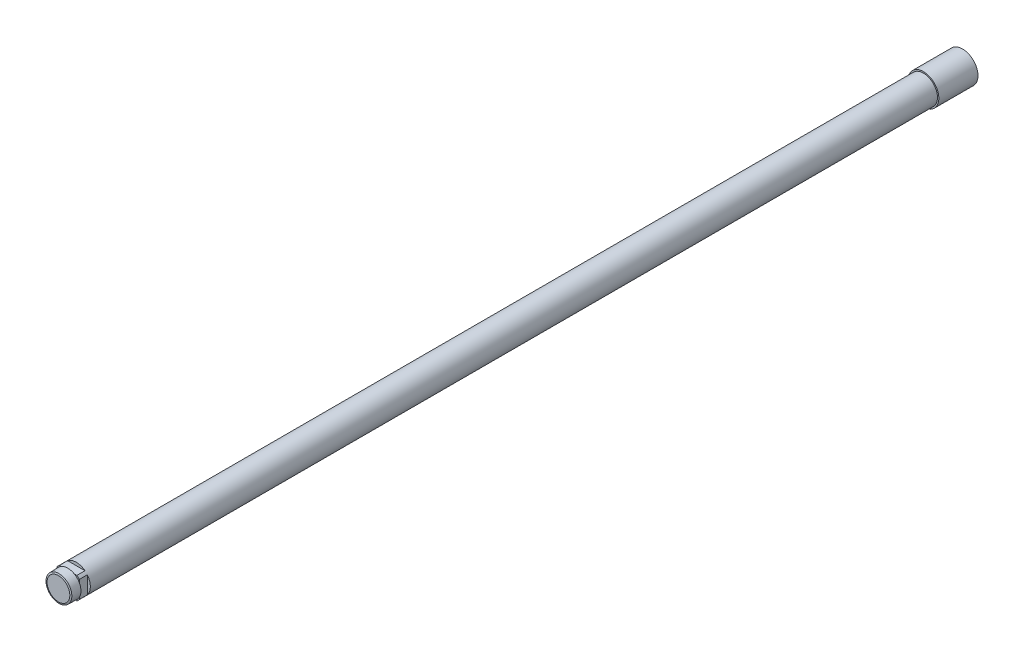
ISO-10303-21;
HEADER;
FILE_DESCRIPTION(('STEP AP214'),'2;1');
FILE_NAME('part.step','',(''),(''),'','','');
FILE_SCHEMA(('AUTOMOTIVE_DESIGN { 1 0 10303 214 1 1 1 1 }'));
ENDSEC;
DATA;
#1=APPLICATION_CONTEXT('core data for automotive mechanical design processes');
#2=APPLICATION_PROTOCOL_DEFINITION('international standard','automotive_design',2000,#1);
#3=PRODUCT_CONTEXT('',#1,'mechanical');
#4=PRODUCT('Part','Part','',(#3));
#5=PRODUCT_RELATED_PRODUCT_CATEGORY('part','',(#4));
#6=PRODUCT_DEFINITION_FORMATION('','',#4);
#7=PRODUCT_DEFINITION_CONTEXT('part definition',#1,'design');
#8=PRODUCT_DEFINITION('design','',#6,#7);
#9=PRODUCT_DEFINITION_SHAPE('','',#8);
#10=(LENGTH_UNIT() NAMED_UNIT(*) SI_UNIT(.MILLI.,.METRE.));
#11=(NAMED_UNIT(*) PLANE_ANGLE_UNIT() SI_UNIT($,.RADIAN.));
#12=(NAMED_UNIT(*) SI_UNIT($,.STERADIAN.) SOLID_ANGLE_UNIT());
#13=UNCERTAINTY_MEASURE_WITH_UNIT(LENGTH_MEASURE(1.E-05),#10,'distance_accuracy_value','');
#14=(GEOMETRIC_REPRESENTATION_CONTEXT(3) GLOBAL_UNCERTAINTY_ASSIGNED_CONTEXT((#13)) GLOBAL_UNIT_ASSIGNED_CONTEXT((#10,
#11,#12)) REPRESENTATION_CONTEXT('',''));
#15=CARTESIAN_POINT('',(0.,0.,0.));
#16=DIRECTION('',(0.,0.,1.));
#17=DIRECTION('',(1.,0.,0.));
#18=AXIS2_PLACEMENT_3D('',#15,#16,#17);
#19=CARTESIAN_POINT('',(0.,0.,554.3042));
#20=DIRECTION('',(0.,0.,1.));
#21=DIRECTION('',(1.,0.,0.));
#22=AXIS2_PLACEMENT_3D('',#19,#20,#21);
#23=PLANE('',#22);
#24=CARTESIAN_POINT('',(0.,0.,554.3042));
#25=DIRECTION('',(0.,0.,-1.));
#26=DIRECTION('',(-1.,0.,0.));
#27=AXIS2_PLACEMENT_3D('',#24,#25,#26);
#28=CIRCLE('',#27,17.9959);
#29=CARTESIAN_POINT('',(-17.9959,0.,554.3042));
#30=VERTEX_POINT('',#29);
#31=EDGE_CURVE('E132',#30,#30,#28,.T.);
#32=ORIENTED_EDGE('',*,*,#31,.F.);
#33=EDGE_LOOP('',(#32));
#34=FACE_BOUND('',#33,.T.);
#35=ADVANCED_FACE('F35',(#34),#23,.T.);
#36=CARTESIAN_POINT('',(0.,0.,553.5583925));
#37=DIRECTION('',(0.,0.,-1.));
#38=DIRECTION('',(-1.,0.,0.));
#39=AXIS2_PLACEMENT_3D('',#36,#37,#38);
#40=CONICAL_SURFACE('',#39,20.4193773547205,1.27225134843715);
#41=CARTESIAN_POINT('',(0.,0.,553.5583925));
#42=DIRECTION('',(0.,0.,-1.));
#43=DIRECTION('',(-1.,0.,0.));
#44=AXIS2_PLACEMENT_3D('',#41,#42,#43);
#45=CIRCLE('',#44,20.4193773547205);
#46=CARTESIAN_POINT('',(-20.4193773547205,0.,553.5583925));
#47=VERTEX_POINT('',#46);
#48=EDGE_CURVE('E128',#47,#47,#45,.T.);
#49=ORIENTED_EDGE('',*,*,#48,.F.);
#50=EDGE_LOOP('',(#49));
#51=FACE_BOUND('',#50,.T.);
#52=ORIENTED_EDGE('',*,*,#31,.T.);
#53=EDGE_LOOP('',(#52));
#54=FACE_BOUND('',#53,.T.);
#55=ADVANCED_FACE('F367',(#51,#54),#40,.T.);
#56=CARTESIAN_POINT('',(0.,0.,538.8356));
#57=DIRECTION('',(0.,0.,1.));
#58=DIRECTION('',(1.,0.,0.));
#59=AXIS2_PLACEMENT_3D('',#56,#57,#58);
#60=PLANE('',#59);
#61=DIRECTION('',(1.,0.,0.));
#62=VECTOR('',#61,1.);
#63=CARTESIAN_POINT('',(-17.4625,-17.4625,538.8356));
#64=LINE('',#63,#62);
#65=CARTESIAN_POINT('',(6.03708657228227,-17.4625,538.8356));
#66=VERTEX_POINT('',#65);
#67=CARTESIAN_POINT('',(-6.03708657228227,-17.4625,538.8356));
#68=VERTEX_POINT('',#67);
#69=EDGE_CURVE('E138',#66,#68,#64,.F.);
#70=ORIENTED_EDGE('',*,*,#69,.F.);
#71=CARTESIAN_POINT('',(0.,0.,538.8356));
#72=DIRECTION('',(0.,0.,1.));
#73=DIRECTION('',(1.,0.,0.));
#74=AXIS2_PLACEMENT_3D('',#71,#72,#73);
#75=CIRCLE('',#74,18.4766155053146);
#76=EDGE_CURVE('E247',#68,#66,#75,.T.);
#77=ORIENTED_EDGE('',*,*,#76,.F.);
#78=EDGE_LOOP('',(#70,#77));
#79=FACE_BOUND('',#78,.T.);
#80=ADVANCED_FACE('F249',(#79),#60,.F.);
#81=CARTESIAN_POINT('',(0.,0.,539.5814075));
#82=DIRECTION('',(0.,0.,-1.));
#83=DIRECTION('',(-1.,0.,0.));
#84=AXIS2_PLACEMENT_3D('',#81,#82,#83);
#85=CONICAL_SURFACE('',#84,20.8537381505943,0.0310668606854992);
#86=CARTESIAN_POINT('',(0.,0.,539.5814075));
#87=DIRECTION('',(0.,0.,1.));
#88=DIRECTION('',(1.,0.,0.));
#89=AXIS2_PLACEMENT_3D('',#86,#87,#88);
#90=CIRCLE('',#89,20.8537381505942);
#91=CARTESIAN_POINT('',(20.8537381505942,0.,539.5814075));
#92=VERTEX_POINT('',#91);
#93=EDGE_CURVE('E133',#92,#92,#90,.F.);
#94=ORIENTED_EDGE('',*,*,#93,.F.);
#95=EDGE_LOOP('',(#94));
#96=FACE_BOUND('',#95,.T.);
#97=ORIENTED_EDGE('',*,*,#48,.T.);
#98=EDGE_LOOP('',(#97));
#99=FACE_BOUND('',#98,.T.);
#100=ADVANCED_FACE('F361',(#96,#99),#85,.T.);
#101=CARTESIAN_POINT('',(0.,0.,526.1356));
#102=DIRECTION('',(0.,0.,1.));
#103=DIRECTION('',(1.,0.,0.));
#104=AXIS2_PLACEMENT_3D('',#101,#102,#103);
#105=PLANE('',#104);
#106=CARTESIAN_POINT('',(0.,0.,526.1356));
#107=DIRECTION('',(0.,0.,-1.));
#108=DIRECTION('',(-1.,0.,0.));
#109=AXIS2_PLACEMENT_3D('',#106,#107,#108);
#110=CIRCLE('',#109,22.225);
#111=CARTESIAN_POINT('',(13.748153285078,-17.4625,526.1356));
#112=VERTEX_POINT('',#111);
#113=CARTESIAN_POINT('',(-13.748153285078,-17.4625,526.1356));
#114=VERTEX_POINT('',#113);
#115=EDGE_CURVE('E145',#112,#114,#110,.T.);
#116=ORIENTED_EDGE('',*,*,#115,.F.);
#117=DIRECTION('',(1.,0.,0.));
#118=VECTOR('',#117,1.);
#119=CARTESIAN_POINT('',(-17.4625,-17.4625,526.1356));
#120=LINE('',#119,#118);
#121=EDGE_CURVE('E131',#114,#112,#120,.T.);
#122=ORIENTED_EDGE('',*,*,#121,.F.);
#123=EDGE_LOOP('',(#116,#122));
#124=FACE_BOUND('',#123,.T.);
#125=ADVANCED_FACE('F271',(#124),#105,.T.);
#126=CARTESIAN_POINT('',(-17.4625,-17.4625,526.1356));
#127=DIRECTION('',(0.,-1.,0.));
#128=DIRECTION('',(0.,0.,-1.));
#129=AXIS2_PLACEMENT_3D('',#126,#127,#128);
#130=PLANE('',#129);
#131=DIRECTION('',(1.,0.,0.));
#132=VECTOR('',#131,1.);
#133=CARTESIAN_POINT('',(0.,-17.4625,538.8356));
#134=LINE('',#133,#132);
#135=CARTESIAN_POINT('',(-13.748153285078,-17.4625,538.8356));
#136=VERTEX_POINT('',#135);
#137=EDGE_CURVE('E141',#136,#68,#134,.T.);
#138=ORIENTED_EDGE('',*,*,#137,.F.);
#139=DIRECTION('',(0.,0.,-1.));
#140=VECTOR('',#139,1.);
#141=CARTESIAN_POINT('',(-13.748153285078,-17.4625,554.3042));
#142=LINE('',#141,#140);
#143=EDGE_CURVE('E149',#114,#136,#142,.F.);
#144=ORIENTED_EDGE('',*,*,#143,.F.);
#145=ORIENTED_EDGE('',*,*,#121,.T.);
#146=DIRECTION('',(0.,0.,-1.));
#147=VECTOR('',#146,1.);
#148=CARTESIAN_POINT('',(13.748153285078,-17.4625,554.3042));
#149=LINE('',#148,#147);
#150=CARTESIAN_POINT('',(13.748153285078,-17.4625,538.8356));
#151=VERTEX_POINT('',#150);
#152=EDGE_CURVE('E142',#151,#112,#149,.T.);
#153=ORIENTED_EDGE('',*,*,#152,.F.);
#154=DIRECTION('',(1.,0.,0.));
#155=VECTOR('',#154,1.);
#156=CARTESIAN_POINT('',(0.,-17.4625,538.8356));
#157=LINE('',#156,#155);
#158=EDGE_CURVE('E172',#66,#151,#157,.T.);
#159=ORIENTED_EDGE('',*,*,#158,.F.);
#160=ORIENTED_EDGE('',*,*,#69,.T.);
#161=EDGE_LOOP('',(#138,#144,#145,#153,#159,#160));
#162=FACE_BOUND('',#161,.T.);
#163=ADVANCED_FACE('F260',(#162),#130,.T.);
#164=CARTESIAN_POINT('',(0.,22.225,538.8356));
#165=DIRECTION('',(0.,0.,1.));
#166=DIRECTION('',(1.,0.,0.));
#167=AXIS2_PLACEMENT_3D('',#164,#165,#166);
#168=PLANE('',#167);
#169=DIRECTION('',(0.,1.,0.));
#170=VECTOR('',#169,1.);
#171=CARTESIAN_POINT('',(-17.4625,-17.4625,538.8356));
#172=LINE('',#171,#170);
#173=CARTESIAN_POINT('',(-17.4625,-13.748153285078,538.8356));
#174=VERTEX_POINT('',#173);
#175=CARTESIAN_POINT('',(-17.4625,-6.03708657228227,538.8356));
#176=VERTEX_POINT('',#175);
#177=EDGE_CURVE('E154',#174,#176,#172,.T.);
#178=ORIENTED_EDGE('',*,*,#177,.F.);
#179=CARTESIAN_POINT('',(0.,0.,538.8356));
#180=DIRECTION('',(0.,0.,-1.));
#181=DIRECTION('',(-1.,0.,0.));
#182=AXIS2_PLACEMENT_3D('',#179,#180,#181);
#183=CIRCLE('',#182,22.225);
#184=EDGE_CURVE('E54',#136,#174,#183,.T.);
#185=ORIENTED_EDGE('',*,*,#184,.F.);
#186=ORIENTED_EDGE('',*,*,#137,.T.);
#187=CARTESIAN_POINT('',(0.,0.,538.8356));
#188=DIRECTION('',(0.,0.,1.));
#189=DIRECTION('',(1.,0.,0.));
#190=AXIS2_PLACEMENT_3D('',#187,#188,#189);
#191=CIRCLE('',#190,18.4766155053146);
#192=EDGE_CURVE('E137',#68,#176,#191,.F.);
#193=ORIENTED_EDGE('',*,*,#192,.T.);
#194=EDGE_LOOP('',(#178,#185,#186,#193));
#195=FACE_BOUND('',#194,.T.);
#196=ADVANCED_FACE('F280',(#195),#168,.T.);
#197=CARTESIAN_POINT('',(0.,0.,538.8356));
#198=DIRECTION('',(0.,0.,1.));
#199=DIRECTION('',(1.,0.,0.));
#200=AXIS2_PLACEMENT_3D('',#197,#198,#199);
#201=PLANE('',#200);
#202=DIRECTION('',(0.,1.,0.));
#203=VECTOR('',#202,1.);
#204=CARTESIAN_POINT('',(-17.4625,-17.4625,538.8356));
#205=LINE('',#204,#203);
#206=CARTESIAN_POINT('',(-17.4625,6.03708657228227,538.8356));
#207=VERTEX_POINT('',#206);
#208=EDGE_CURVE('E160',#176,#207,#205,.T.);
#209=ORIENTED_EDGE('',*,*,#208,.F.);
#210=CARTESIAN_POINT('',(0.,0.,538.8356));
#211=DIRECTION('',(0.,0.,1.));
#212=DIRECTION('',(1.,0.,0.));
#213=AXIS2_PLACEMENT_3D('',#210,#211,#212);
#214=CIRCLE('',#213,18.4766155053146);
#215=EDGE_CURVE('E257',#207,#176,#214,.T.);
#216=ORIENTED_EDGE('',*,*,#215,.F.);
#217=EDGE_LOOP('',(#209,#216));
#218=FACE_BOUND('',#217,.T.);
#219=ADVANCED_FACE('F275',(#218),#201,.F.);
#220=CARTESIAN_POINT('',(0.,0.,538.8356));
#221=DIRECTION('',(0.,0.,1.));
#222=DIRECTION('',(1.,0.,0.));
#223=AXIS2_PLACEMENT_3D('',#220,#221,#222);
#224=PLANE('',#223);
#225=DIRECTION('',(1.,0.,0.));
#226=VECTOR('',#225,1.);
#227=CARTESIAN_POINT('',(-17.4625,17.4625,538.8356));
#228=LINE('',#227,#226);
#229=CARTESIAN_POINT('',(-6.03708657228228,17.4625,538.8356));
#230=VERTEX_POINT('',#229);
#231=CARTESIAN_POINT('',(6.03708657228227,17.4625,538.8356));
#232=VERTEX_POINT('',#231);
#233=EDGE_CURVE('E164',#230,#232,#228,.T.);
#234=ORIENTED_EDGE('',*,*,#233,.F.);
#235=CARTESIAN_POINT('',(0.,0.,538.8356));
#236=DIRECTION('',(0.,0.,1.));
#237=DIRECTION('',(1.,0.,0.));
#238=AXIS2_PLACEMENT_3D('',#235,#236,#237);
#239=CIRCLE('',#238,18.4766155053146);
#240=EDGE_CURVE('E136',#232,#230,#239,.T.);
#241=ORIENTED_EDGE('',*,*,#240,.F.);
#242=EDGE_LOOP('',(#234,#241));
#243=FACE_BOUND('',#242,.T.);
#244=ADVANCED_FACE('F348',(#243),#224,.F.);
#245=CARTESIAN_POINT('',(0.,0.,539.5814075));
#246=DIRECTION('',(0.,0.,1.));
#247=DIRECTION('',(1.,0.,0.));
#248=AXIS2_PLACEMENT_3D('',#245,#246,#247);
#249=CONICAL_SURFACE('',#248,20.8537381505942,1.26677871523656);
#250=ORIENTED_EDGE('',*,*,#93,.T.);
#251=EDGE_LOOP('',(#250));
#252=FACE_BOUND('',#251,.T.);
#253=ORIENTED_EDGE('',*,*,#240,.T.);
#254=CARTESIAN_POINT('',(0.,0.,538.8356));
#255=DIRECTION('',(0.,0.,1.));
#256=DIRECTION('',(1.,0.,0.));
#257=AXIS2_PLACEMENT_3D('',#254,#255,#256);
#258=CIRCLE('',#257,18.4766155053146);
#259=EDGE_CURVE('E187',#207,#230,#258,.F.);
#260=ORIENTED_EDGE('',*,*,#259,.F.);
#261=ORIENTED_EDGE('',*,*,#215,.T.);
#262=ORIENTED_EDGE('',*,*,#192,.F.);
#263=ORIENTED_EDGE('',*,*,#76,.T.);
#264=CARTESIAN_POINT('',(0.,0.,538.8356));
#265=DIRECTION('',(0.,0.,1.));
#266=DIRECTION('',(1.,0.,0.));
#267=AXIS2_PLACEMENT_3D('',#264,#265,#266);
#268=CIRCLE('',#267,18.4766155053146);
#269=CARTESIAN_POINT('',(17.4625,-6.03708657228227,538.8356));
#270=VERTEX_POINT('',#269);
#271=EDGE_CURVE('E175',#270,#66,#268,.F.);
#272=ORIENTED_EDGE('',*,*,#271,.F.);
#273=CARTESIAN_POINT('',(0.,0.,538.8356));
#274=DIRECTION('',(0.,0.,1.));
#275=DIRECTION('',(1.,0.,0.));
#276=AXIS2_PLACEMENT_3D('',#273,#274,#275);
#277=CIRCLE('',#276,18.4766155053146);
#278=CARTESIAN_POINT('',(17.4625,6.03708657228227,538.8356));
#279=VERTEX_POINT('',#278);
#280=EDGE_CURVE('E176',#270,#279,#277,.T.);
#281=ORIENTED_EDGE('',*,*,#280,.T.);
#282=CARTESIAN_POINT('',(0.,0.,538.8356));
#283=DIRECTION('',(0.,0.,1.));
#284=DIRECTION('',(1.,0.,0.));
#285=AXIS2_PLACEMENT_3D('',#282,#283,#284);
#286=CIRCLE('',#285,18.4766155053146);
#287=EDGE_CURVE('E102',#232,#279,#286,.F.);
#288=ORIENTED_EDGE('',*,*,#287,.F.);
#289=EDGE_LOOP('',(#253,#260,#261,#262,#263,#272,#281,#288));
#290=FACE_BOUND('',#289,.T.);
#291=ADVANCED_FACE('F253',(#252,#290),#249,.T.);
#292=CARTESIAN_POINT('',(0.,0.,538.8356));
#293=DIRECTION('',(0.,0.,1.));
#294=DIRECTION('',(1.,0.,0.));
#295=AXIS2_PLACEMENT_3D('',#292,#293,#294);
#296=PLANE('',#295);
#297=DIRECTION('',(0.,1.,0.));
#298=VECTOR('',#297,1.);
#299=CARTESIAN_POINT('',(17.4625,-17.4625,538.8356));
#300=LINE('',#299,#298);
#301=EDGE_CURVE('E106',#279,#270,#300,.F.);
#302=ORIENTED_EDGE('',*,*,#301,.F.);
#303=ORIENTED_EDGE('',*,*,#280,.F.);
#304=EDGE_LOOP('',(#302,#303));
#305=FACE_BOUND('',#304,.T.);
#306=ADVANCED_FACE('F342',(#305),#296,.F.);
#307=CARTESIAN_POINT('',(0.,22.225,538.8356));
#308=DIRECTION('',(0.,0.,1.));
#309=DIRECTION('',(1.,0.,0.));
#310=AXIS2_PLACEMENT_3D('',#307,#308,#309);
#311=PLANE('',#310);
#312=ORIENTED_EDGE('',*,*,#158,.T.);
#313=CARTESIAN_POINT('',(0.,0.,538.8356));
#314=DIRECTION('',(0.,0.,-1.));
#315=DIRECTION('',(-1.,0.,0.));
#316=AXIS2_PLACEMENT_3D('',#313,#314,#315);
#317=CIRCLE('',#316,22.225);
#318=CARTESIAN_POINT('',(17.4625,-13.748153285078,538.8356));
#319=VERTEX_POINT('',#318);
#320=EDGE_CURVE('E146',#319,#151,#317,.T.);
#321=ORIENTED_EDGE('',*,*,#320,.F.);
#322=DIRECTION('',(0.,1.,0.));
#323=VECTOR('',#322,1.);
#324=CARTESIAN_POINT('',(17.4625,-17.4625,538.8356));
#325=LINE('',#324,#323);
#326=EDGE_CURVE('E170',#270,#319,#325,.F.);
#327=ORIENTED_EDGE('',*,*,#326,.F.);
#328=ORIENTED_EDGE('',*,*,#271,.T.);
#329=EDGE_LOOP('',(#312,#321,#327,#328));
#330=FACE_BOUND('',#329,.T.);
#331=ADVANCED_FACE('F264',(#330),#311,.T.);
#332=CARTESIAN_POINT('',(0.,0.,526.1356));
#333=DIRECTION('',(0.,0.,1.));
#334=DIRECTION('',(1.,0.,0.));
#335=AXIS2_PLACEMENT_3D('',#332,#333,#334);
#336=PLANE('',#335);
#337=CARTESIAN_POINT('',(0.,0.,526.1356));
#338=DIRECTION('',(0.,0.,-1.));
#339=DIRECTION('',(-1.,0.,0.));
#340=AXIS2_PLACEMENT_3D('',#337,#338,#339);
#341=CIRCLE('',#340,22.225);
#342=CARTESIAN_POINT('',(17.4625,13.748153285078,526.1356));
#343=VERTEX_POINT('',#342);
#344=CARTESIAN_POINT('',(17.4625,-13.748153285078,526.1356));
#345=VERTEX_POINT('',#344);
#346=EDGE_CURVE('E116',#343,#345,#341,.T.);
#347=ORIENTED_EDGE('',*,*,#346,.F.);
#348=DIRECTION('',(0.,1.,0.));
#349=VECTOR('',#348,1.);
#350=CARTESIAN_POINT('',(17.4625,-17.4625,526.1356));
#351=LINE('',#350,#349);
#352=EDGE_CURVE('E107',#345,#343,#351,.T.);
#353=ORIENTED_EDGE('',*,*,#352,.F.);
#354=EDGE_LOOP('',(#347,#353));
#355=FACE_BOUND('',#354,.T.);
#356=ADVANCED_FACE('F335',(#355),#336,.T.);
#357=CARTESIAN_POINT('',(0.,0.,526.1356));
#358=DIRECTION('',(0.,0.,1.));
#359=DIRECTION('',(1.,0.,0.));
#360=AXIS2_PLACEMENT_3D('',#357,#358,#359);
#361=PLANE('',#360);
#362=CARTESIAN_POINT('',(0.,0.,526.1356));
#363=DIRECTION('',(0.,0.,-1.));
#364=DIRECTION('',(-1.,0.,0.));
#365=AXIS2_PLACEMENT_3D('',#362,#363,#364);
#366=CIRCLE('',#365,22.225);
#367=CARTESIAN_POINT('',(-17.4625,-13.748153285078,526.1356));
#368=VERTEX_POINT('',#367);
#369=CARTESIAN_POINT('',(-17.4625,13.748153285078,526.1356));
#370=VERTEX_POINT('',#369);
#371=EDGE_CURVE('E184',#368,#370,#366,.T.);
#372=ORIENTED_EDGE('',*,*,#371,.F.);
#373=DIRECTION('',(0.,1.,0.));
#374=VECTOR('',#373,1.);
#375=CARTESIAN_POINT('',(-17.4625,-17.4625,526.1356));
#376=LINE('',#375,#374);
#377=EDGE_CURVE('E155',#370,#368,#376,.F.);
#378=ORIENTED_EDGE('',*,*,#377,.F.);
#379=EDGE_LOOP('',(#372,#378));
#380=FACE_BOUND('',#379,.T.);
#381=ADVANCED_FACE('F332',(#380),#361,.T.);
#382=CARTESIAN_POINT('',(-17.4625,-17.4625,526.1356));
#383=DIRECTION('',(-1.,0.,0.));
#384=DIRECTION('',(0.,0.,1.));
#385=AXIS2_PLACEMENT_3D('',#382,#383,#384);
#386=PLANE('',#385);
#387=DIRECTION('',(0.,1.,0.));
#388=VECTOR('',#387,1.);
#389=CARTESIAN_POINT('',(-17.4625,22.225,538.8356));
#390=LINE('',#389,#388);
#391=CARTESIAN_POINT('',(-17.4625,13.748153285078,538.8356));
#392=VERTEX_POINT('',#391);
#393=EDGE_CURVE('E163',#392,#207,#390,.F.);
#394=ORIENTED_EDGE('',*,*,#393,.F.);
#395=DIRECTION('',(0.,0.,-1.));
#396=VECTOR('',#395,1.);
#397=CARTESIAN_POINT('',(-17.4625,13.748153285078,554.3042));
#398=LINE('',#397,#396);
#399=EDGE_CURVE('E180',#370,#392,#398,.F.);
#400=ORIENTED_EDGE('',*,*,#399,.F.);
#401=ORIENTED_EDGE('',*,*,#377,.T.);
#402=DIRECTION('',(0.,0.,1.));
#403=VECTOR('',#402,1.);
#404=CARTESIAN_POINT('',(-17.4625,-13.748153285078,526.1356));
#405=LINE('',#404,#403);
#406=EDGE_CURVE('E151',#368,#174,#405,.T.);
#407=ORIENTED_EDGE('',*,*,#406,.T.);
#408=ORIENTED_EDGE('',*,*,#177,.T.);
#409=ORIENTED_EDGE('',*,*,#208,.T.);
#410=EDGE_LOOP('',(#394,#400,#401,#407,#408,#409));
#411=FACE_BOUND('',#410,.T.);
#412=ADVANCED_FACE('F278',(#411),#386,.T.);
#413=CARTESIAN_POINT('',(0.,22.225,538.8356));
#414=DIRECTION('',(0.,0.,1.));
#415=DIRECTION('',(1.,0.,0.));
#416=AXIS2_PLACEMENT_3D('',#413,#414,#415);
#417=PLANE('',#416);
#418=DIRECTION('',(1.,0.,0.));
#419=VECTOR('',#418,1.);
#420=CARTESIAN_POINT('',(-17.4625,17.4625,538.8356));
#421=LINE('',#420,#419);
#422=CARTESIAN_POINT('',(-13.748153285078,17.4625,538.8356));
#423=VERTEX_POINT('',#422);
#424=EDGE_CURVE('E167',#423,#230,#421,.T.);
#425=ORIENTED_EDGE('',*,*,#424,.F.);
#426=CARTESIAN_POINT('',(0.,0.,538.8356));
#427=DIRECTION('',(0.,0.,-1.));
#428=DIRECTION('',(-1.,0.,0.));
#429=AXIS2_PLACEMENT_3D('',#426,#427,#428);
#430=CIRCLE('',#429,22.225);
#431=EDGE_CURVE('E183',#392,#423,#430,.T.);
#432=ORIENTED_EDGE('',*,*,#431,.F.);
#433=ORIENTED_EDGE('',*,*,#393,.T.);
#434=ORIENTED_EDGE('',*,*,#259,.T.);
#435=EDGE_LOOP('',(#425,#432,#433,#434));
#436=FACE_BOUND('',#435,.T.);
#437=ADVANCED_FACE('F213',(#436),#417,.T.);
#438=CARTESIAN_POINT('',(0.,0.,526.1356));
#439=DIRECTION('',(0.,0.,1.));
#440=DIRECTION('',(1.,0.,0.));
#441=AXIS2_PLACEMENT_3D('',#438,#439,#440);
#442=PLANE('',#441);
#443=CARTESIAN_POINT('',(0.,0.,526.1356));
#444=DIRECTION('',(0.,0.,-1.));
#445=DIRECTION('',(-1.,0.,0.));
#446=AXIS2_PLACEMENT_3D('',#443,#444,#445);
#447=CIRCLE('',#446,22.225);
#448=CARTESIAN_POINT('',(-13.748153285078,17.4625,526.1356));
#449=VERTEX_POINT('',#448);
#450=CARTESIAN_POINT('',(13.748153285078,17.4625,526.1356));
#451=VERTEX_POINT('',#450);
#452=EDGE_CURVE('E126',#449,#451,#447,.T.);
#453=ORIENTED_EDGE('',*,*,#452,.F.);
#454=DIRECTION('',(1.,0.,0.));
#455=VECTOR('',#454,1.);
#456=CARTESIAN_POINT('',(-17.4625,17.4625,526.1356));
#457=LINE('',#456,#455);
#458=EDGE_CURVE('E190',#451,#449,#457,.F.);
#459=ORIENTED_EDGE('',*,*,#458,.F.);
#460=EDGE_LOOP('',(#453,#459));
#461=FACE_BOUND('',#460,.T.);
#462=ADVANCED_FACE('F198',(#461),#442,.T.);
#463=CARTESIAN_POINT('',(-17.4625,17.4625,526.1356));
#464=DIRECTION('',(0.,1.,0.));
#465=DIRECTION('',(0.,0.,1.));
#466=AXIS2_PLACEMENT_3D('',#463,#464,#465);
#467=PLANE('',#466);
#468=DIRECTION('',(1.,0.,0.));
#469=VECTOR('',#468,1.);
#470=CARTESIAN_POINT('',(0.,17.4625,538.8356));
#471=LINE('',#470,#469);
#472=CARTESIAN_POINT('',(13.748153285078,17.4625,538.8356));
#473=VERTEX_POINT('',#472);
#474=EDGE_CURVE('E39',#473,#232,#471,.F.);
#475=ORIENTED_EDGE('',*,*,#474,.F.);
#476=DIRECTION('',(0.,0.,-1.));
#477=VECTOR('',#476,1.);
#478=CARTESIAN_POINT('',(13.748153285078,17.4625,554.3042));
#479=LINE('',#478,#477);
#480=EDGE_CURVE('E45',#451,#473,#479,.F.);
#481=ORIENTED_EDGE('',*,*,#480,.F.);
#482=ORIENTED_EDGE('',*,*,#458,.T.);
#483=DIRECTION('',(0.,0.,-1.));
#484=VECTOR('',#483,1.);
#485=CARTESIAN_POINT('',(-13.748153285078,17.4625,554.3042));
#486=LINE('',#485,#484);
#487=EDGE_CURVE('E191',#423,#449,#486,.T.);
#488=ORIENTED_EDGE('',*,*,#487,.F.);
#489=ORIENTED_EDGE('',*,*,#424,.T.);
#490=ORIENTED_EDGE('',*,*,#233,.T.);
#491=EDGE_LOOP('',(#475,#481,#482,#488,#489,#490));
#492=FACE_BOUND('',#491,.T.);
#493=ADVANCED_FACE('F201',(#492),#467,.T.);
#494=CARTESIAN_POINT('',(0.,22.225,538.8356));
#495=DIRECTION('',(0.,0.,1.));
#496=DIRECTION('',(1.,0.,0.));
#497=AXIS2_PLACEMENT_3D('',#494,#495,#496);
#498=PLANE('',#497);
#499=DIRECTION('',(0.,1.,0.));
#500=VECTOR('',#499,1.);
#501=CARTESIAN_POINT('',(17.4625,-17.4625,538.8356));
#502=LINE('',#501,#500);
#503=CARTESIAN_POINT('',(17.4625,13.748153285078,538.8356));
#504=VERTEX_POINT('',#503);
#505=EDGE_CURVE('E93',#504,#279,#502,.F.);
#506=ORIENTED_EDGE('',*,*,#505,.F.);
#507=CARTESIAN_POINT('',(0.,0.,538.8356));
#508=DIRECTION('',(0.,0.,-1.));
#509=DIRECTION('',(-1.,0.,0.));
#510=AXIS2_PLACEMENT_3D('',#507,#508,#509);
#511=CIRCLE('',#510,22.225);
#512=EDGE_CURVE('E98',#473,#504,#511,.T.);
#513=ORIENTED_EDGE('',*,*,#512,.F.);
#514=ORIENTED_EDGE('',*,*,#474,.T.);
#515=ORIENTED_EDGE('',*,*,#287,.T.);
#516=EDGE_LOOP('',(#506,#513,#514,#515));
#517=FACE_BOUND('',#516,.T.);
#518=ADVANCED_FACE('F95',(#517),#498,.T.);
#519=CARTESIAN_POINT('',(17.4625,-17.4625,526.1356));
#520=DIRECTION('',(1.,0.,0.));
#521=DIRECTION('',(0.,1.,0.));
#522=AXIS2_PLACEMENT_3D('',#519,#520,#521);
#523=PLANE('',#522);
#524=ORIENTED_EDGE('',*,*,#326,.T.);
#525=DIRECTION('',(0.,0.,1.));
#526=VECTOR('',#525,1.);
#527=CARTESIAN_POINT('',(17.4625,-13.748153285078,526.1356));
#528=LINE('',#527,#526);
#529=EDGE_CURVE('E168',#319,#345,#528,.F.);
#530=ORIENTED_EDGE('',*,*,#529,.T.);
#531=ORIENTED_EDGE('',*,*,#352,.T.);
#532=DIRECTION('',(0.,0.,-1.));
#533=VECTOR('',#532,1.);
#534=CARTESIAN_POINT('',(17.4625,13.748153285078,554.3042));
#535=LINE('',#534,#533);
#536=EDGE_CURVE('E111',#504,#343,#535,.T.);
#537=ORIENTED_EDGE('',*,*,#536,.F.);
#538=ORIENTED_EDGE('',*,*,#505,.T.);
#539=ORIENTED_EDGE('',*,*,#301,.T.);
#540=EDGE_LOOP('',(#524,#530,#531,#537,#538,#539));
#541=FACE_BOUND('',#540,.T.);
#542=ADVANCED_FACE('F113',(#541),#523,.T.);
#543=CARTESIAN_POINT('',(0.,0.,554.3042));
#544=DIRECTION('',(0.,0.,-1.));
#545=DIRECTION('',(-1.,0.,0.));
#546=AXIS2_PLACEMENT_3D('',#543,#544,#545);
#547=CYLINDRICAL_SURFACE('',#546,22.225);
#548=ORIENTED_EDGE('',*,*,#512,.T.);
#549=ORIENTED_EDGE('',*,*,#536,.T.);
#550=ORIENTED_EDGE('',*,*,#346,.T.);
#551=ORIENTED_EDGE('',*,*,#529,.F.);
#552=ORIENTED_EDGE('',*,*,#320,.T.);
#553=ORIENTED_EDGE('',*,*,#152,.T.);
#554=ORIENTED_EDGE('',*,*,#115,.T.);
#555=ORIENTED_EDGE('',*,*,#143,.T.);
#556=ORIENTED_EDGE('',*,*,#184,.T.);
#557=ORIENTED_EDGE('',*,*,#406,.F.);
#558=ORIENTED_EDGE('',*,*,#371,.T.);
#559=ORIENTED_EDGE('',*,*,#399,.T.);
#560=ORIENTED_EDGE('',*,*,#431,.T.);
#561=ORIENTED_EDGE('',*,*,#487,.T.);
#562=ORIENTED_EDGE('',*,*,#452,.T.);
#563=ORIENTED_EDGE('',*,*,#480,.T.);
#564=EDGE_LOOP('',(#548,#549,#550,#551,#552,#553,#554,#555,#556,#557,#558,#559,#560,#561,#562,#563));
#565=FACE_BOUND('',#564,.T.);
#566=CARTESIAN_POINT('',(0.,0.,-812.8));
#567=DIRECTION('',(0.,0.,-1.));
#568=DIRECTION('',(-1.,0.,0.));
#569=AXIS2_PLACEMENT_3D('',#566,#567,#568);
#570=CIRCLE('',#569,22.225);
#571=CARTESIAN_POINT('',(-22.225,0.,-812.8));
#572=VERTEX_POINT('',#571);
#573=EDGE_CURVE('E284',#572,#572,#570,.T.);
#574=ORIENTED_EDGE('',*,*,#573,.F.);
#575=EDGE_LOOP('',(#574));
#576=FACE_BOUND('',#575,.T.);
#577=ADVANCED_FACE('F118',(#565,#576),#547,.T.);
#578=CARTESIAN_POINT('',(0.,0.,-874.6998));
#579=DIRECTION('',(0.,0.,1.));
#580=DIRECTION('',(1.,0.,0.));
#581=AXIS2_PLACEMENT_3D('',#578,#579,#580);
#582=CYLINDRICAL_SURFACE('',#581,24.384);
#583=CARTESIAN_POINT('',(0.,0.,-874.6998));
#584=DIRECTION('',(0.,0.,1.));
#585=DIRECTION('',(1.,0.,0.));
#586=AXIS2_PLACEMENT_3D('',#583,#584,#585);
#587=CIRCLE('',#586,24.384);
#588=CARTESIAN_POINT('',(24.384,0.,-874.6998));
#589=VERTEX_POINT('',#588);
#590=EDGE_CURVE('E292',#589,#589,#587,.T.);
#591=ORIENTED_EDGE('',*,*,#590,.T.);
#592=EDGE_LOOP('',(#591));
#593=FACE_BOUND('',#592,.T.);
#594=CARTESIAN_POINT('',(0.,0.,-812.8));
#595=DIRECTION('',(0.,0.,1.));
#596=DIRECTION('',(1.,0.,0.));
#597=AXIS2_PLACEMENT_3D('',#594,#595,#596);
#598=CIRCLE('',#597,24.384);
#599=CARTESIAN_POINT('',(24.384,0.,-812.8));
#600=VERTEX_POINT('',#599);
#601=EDGE_CURVE('E288',#600,#600,#598,.F.);
#602=ORIENTED_EDGE('',*,*,#601,.T.);
#603=EDGE_LOOP('',(#602));
#604=FACE_BOUND('',#603,.T.);
#605=ADVANCED_FACE('F298',(#593,#604),#582,.T.);
#606=CARTESIAN_POINT('',(0.,0.,-812.8));
#607=DIRECTION('',(0.,0.,-1.));
#608=DIRECTION('',(-1.,0.,0.));
#609=AXIS2_PLACEMENT_3D('',#606,#607,#608);
#610=PLANE('',#609);
#611=ORIENTED_EDGE('',*,*,#573,.T.);
#612=EDGE_LOOP('',(#611));
#613=FACE_BOUND('',#612,.T.);
#614=ORIENTED_EDGE('',*,*,#601,.F.);
#615=EDGE_LOOP('',(#614));
#616=FACE_BOUND('',#615,.T.);
#617=ADVANCED_FACE('F300',(#613,#616),#610,.F.);
#618=CARTESIAN_POINT('',(0.,0.,-874.6998));
#619=DIRECTION('',(0.,0.,-1.));
#620=DIRECTION('',(-1.,0.,0.));
#621=AXIS2_PLACEMENT_3D('',#618,#619,#620);
#622=PLANE('',#621);
#623=ORIENTED_EDGE('',*,*,#590,.F.);
#624=EDGE_LOOP('',(#623));
#625=FACE_BOUND('',#624,.T.);
#626=CARTESIAN_POINT('',(0.,0.,-874.6998));
#627=DIRECTION('',(0.,0.,-1.));
#628=DIRECTION('',(-1.,0.,0.));
#629=AXIS2_PLACEMENT_3D('',#626,#627,#628);
#630=CIRCLE('',#629,9.525);
#631=CARTESIAN_POINT('',(-9.525,0.,-874.6998));
#632=VERTEX_POINT('',#631);
#633=EDGE_CURVE('E289',#632,#632,#630,.F.);
#634=ORIENTED_EDGE('',*,*,#633,.T.);
#635=EDGE_LOOP('',(#634));
#636=FACE_BOUND('',#635,.T.);
#637=ADVANCED_FACE('F302',(#625,#636),#622,.T.);
#638=CARTESIAN_POINT('',(0.,0.,401.6502));
#639=DIRECTION('',(0.,0.,1.));
#640=DIRECTION('',(1.,0.,0.));
#641=AXIS2_PLACEMENT_3D('',#638,#639,#640);
#642=PLANE('',#641);
#643=CARTESIAN_POINT('',(0.,0.,401.6502));
#644=DIRECTION('',(0.,0.,-1.));
#645=DIRECTION('',(-1.,0.,0.));
#646=AXIS2_PLACEMENT_3D('',#643,#644,#645);
#647=CIRCLE('',#646,9.525);
#648=CARTESIAN_POINT('',(-9.525,0.,401.6502));
#649=VERTEX_POINT('',#648);
#650=EDGE_CURVE('E11',#649,#649,#647,.T.);
#651=ORIENTED_EDGE('',*,*,#650,.T.);
#652=EDGE_LOOP('',(#651));
#653=FACE_BOUND('',#652,.T.);
#654=ADVANCED_FACE('F310',(#653),#642,.F.);
#655=CARTESIAN_POINT('',(0.,0.,581.244968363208));
#656=DIRECTION('',(0.,0.,-1.));
#657=DIRECTION('',(-1.,0.,0.));
#658=AXIS2_PLACEMENT_3D('',#655,#656,#657);
#659=CYLINDRICAL_SURFACE('',#658,9.525);
#660=ORIENTED_EDGE('',*,*,#650,.F.);
#661=EDGE_LOOP('',(#660));
#662=FACE_BOUND('',#661,.T.);
#663=ORIENTED_EDGE('',*,*,#633,.F.);
#664=EDGE_LOOP('',(#663));
#665=FACE_BOUND('',#664,.T.);
#666=ADVANCED_FACE('F37',(#662,#665),#659,.F.);
#667=CLOSED_SHELL('',(#35,#55,#80,#100,#125,#163,#196,#219,#244,#291,#306,#331,#356,#381,#412,
#437,#462,#493,#518,#542,#577,#605,#617,#637,#654,#666));
#668=MANIFOLD_SOLID_BREP('B2',#667);
#669=ADVANCED_BREP_SHAPE_REPRESENTATION('',(#18,#668),#14);
#670=SHAPE_DEFINITION_REPRESENTATION(#9,#669);
ENDSEC;
END-ISO-10303-21;
